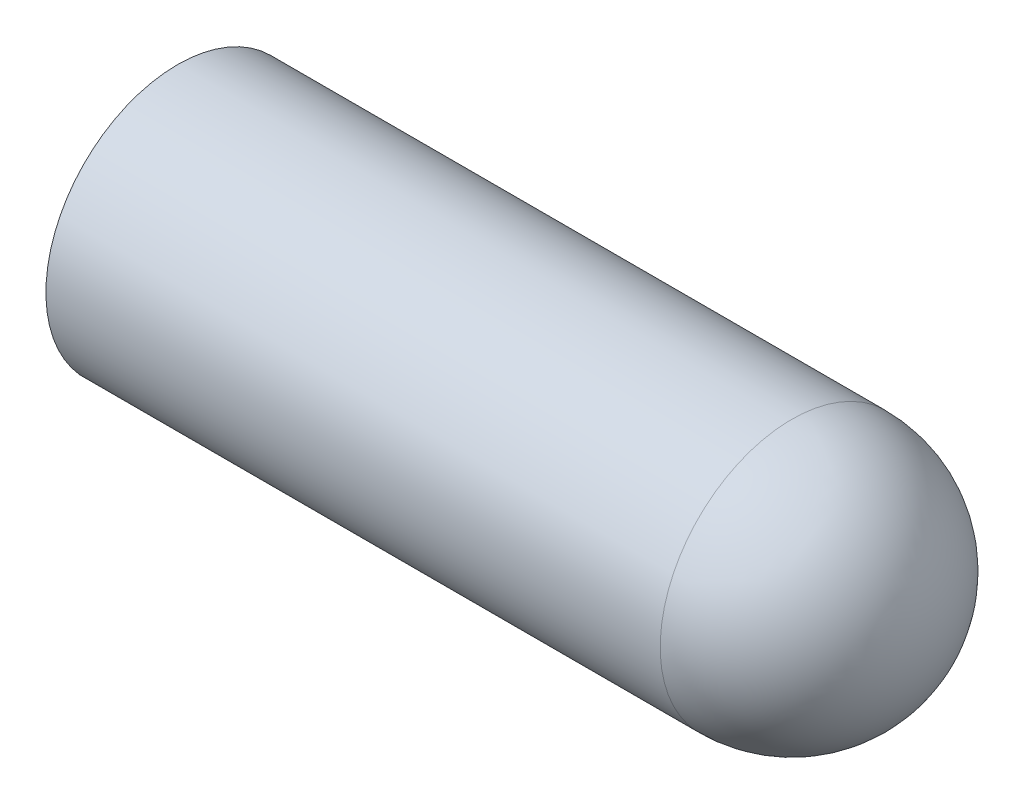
ISO-10303-21;
HEADER;
FILE_DESCRIPTION(('STEP AP214'),'2;1');
FILE_NAME('part.step','',(''),(''),'','','');
FILE_SCHEMA(('AUTOMOTIVE_DESIGN { 1 0 10303 214 1 1 1 1 }'));
ENDSEC;
DATA;
#1=APPLICATION_CONTEXT('core data for automotive mechanical design processes');
#2=APPLICATION_PROTOCOL_DEFINITION('international standard','automotive_design',2000,#1);
#3=PRODUCT_CONTEXT('',#1,'mechanical');
#4=PRODUCT('Part','Part','',(#3));
#5=PRODUCT_RELATED_PRODUCT_CATEGORY('part','',(#4));
#6=PRODUCT_DEFINITION_FORMATION('','',#4);
#7=PRODUCT_DEFINITION_CONTEXT('part definition',#1,'design');
#8=PRODUCT_DEFINITION('design','',#6,#7);
#9=PRODUCT_DEFINITION_SHAPE('','',#8);
#10=(LENGTH_UNIT() NAMED_UNIT(*) SI_UNIT(.MILLI.,.METRE.));
#11=(NAMED_UNIT(*) PLANE_ANGLE_UNIT() SI_UNIT($,.RADIAN.));
#12=(NAMED_UNIT(*) SI_UNIT($,.STERADIAN.) SOLID_ANGLE_UNIT());
#13=UNCERTAINTY_MEASURE_WITH_UNIT(LENGTH_MEASURE(1.E-05),#10,'distance_accuracy_value','');
#14=(GEOMETRIC_REPRESENTATION_CONTEXT(3) GLOBAL_UNCERTAINTY_ASSIGNED_CONTEXT((#13)) GLOBAL_UNIT_ASSIGNED_CONTEXT((#10,
#11,#12)) REPRESENTATION_CONTEXT('',''));
#15=CARTESIAN_POINT('',(0.,0.,0.));
#16=DIRECTION('',(0.,0.,1.));
#17=DIRECTION('',(1.,0.,0.));
#18=AXIS2_PLACEMENT_3D('',#15,#16,#17);
#19=CARTESIAN_POINT('',(-130.8425,-129.35,0.));
#20=DIRECTION('',(-1.,0.,0.));
#21=DIRECTION('',(0.,-1.,0.));
#22=AXIS2_PLACEMENT_3D('',#19,#20,#21);
#23=CYLINDRICAL_SURFACE('',#22,1.4925);
#24=CARTESIAN_POINT('',(-132.335,-129.35,0.));
#25=DIRECTION('',(-1.,0.,0.));
#26=DIRECTION('',(0.,0.,-1.));
#27=AXIS2_PLACEMENT_3D('',#24,#25,#26);
#28=CIRCLE('',#27,1.4925);
#29=CARTESIAN_POINT('',(-132.335,-129.35,-1.4925));
#30=VERTEX_POINT('',#29);
#31=EDGE_CURVE('E10',#30,#30,#28,.T.);
#32=ORIENTED_EDGE('',*,*,#31,.T.);
#33=EDGE_LOOP('',(#32));
#34=FACE_BOUND('',#33,.T.);
#35=CARTESIAN_POINT('',(-139.3,-129.35,0.));
#36=DIRECTION('',(1.,0.,0.));
#37=DIRECTION('',(0.,1.,0.));
#38=AXIS2_PLACEMENT_3D('',#35,#36,#37);
#39=CIRCLE('',#38,1.4925);
#40=CARTESIAN_POINT('',(-139.3,-127.8575,0.));
#41=VERTEX_POINT('',#40);
#42=EDGE_CURVE('E21',#41,#41,#39,.T.);
#43=ORIENTED_EDGE('',*,*,#42,.T.);
#44=EDGE_LOOP('',(#43));
#45=FACE_BOUND('',#44,.T.);
#46=ADVANCED_FACE('F14',(#34,#45),#23,.T.);
#47=CARTESIAN_POINT('',(-139.3,-129.35,0.));
#48=DIRECTION('',(1.,0.,0.));
#49=DIRECTION('',(0.,1.,0.));
#50=AXIS2_PLACEMENT_3D('',#47,#48,#49);
#51=PLANE('',#50);
#52=ORIENTED_EDGE('',*,*,#42,.F.);
#53=EDGE_LOOP('',(#52));
#54=FACE_BOUND('',#53,.T.);
#55=ADVANCED_FACE('F47',(#54),#51,.F.);
#56=CARTESIAN_POINT('',(-132.335,-129.35,0.));
#57=DIRECTION('',(0.,0.,1.));
#58=DIRECTION('',(-1.,0.,0.));
#59=AXIS2_PLACEMENT_3D('',#56,#57,#58);
#60=SPHERICAL_SURFACE('',#59,1.4925);
#61=CARTESIAN_POINT('',(-132.335,-129.35,0.));
#62=DIRECTION('',(-1.,0.,0.));
#63=DIRECTION('',(0.,0.,-1.));
#64=AXIS2_PLACEMENT_3D('',#61,#62,#63);
#65=SPHERICAL_SURFACE('',#64,1.4925);
#66=ORIENTED_EDGE('',*,*,#31,.F.);
#67=EDGE_LOOP('',(#66));
#68=FACE_BOUND('',#67,.T.);
#69=ADVANCED_FACE('F49',(#68),#65,.T.);
#70=CLOSED_SHELL('',(#46,#55,#69));
#71=MANIFOLD_SOLID_BREP('B1',#70);
#72=ADVANCED_BREP_SHAPE_REPRESENTATION('',(#18,#71),#14);
#73=SHAPE_DEFINITION_REPRESENTATION(#9,#72);
ENDSEC;
END-ISO-10303-21;
